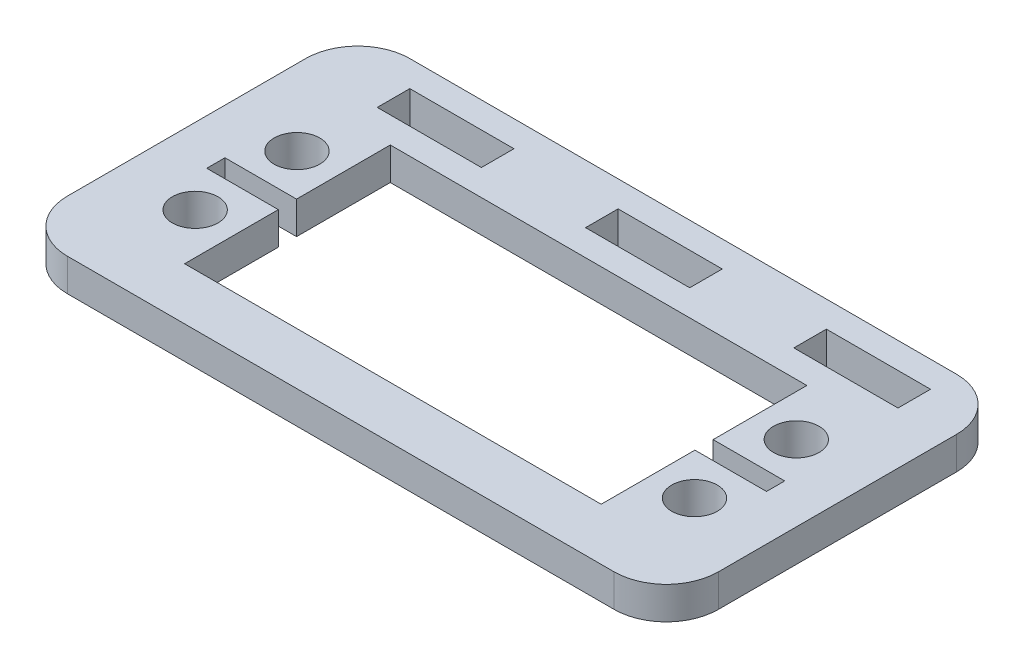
ISO-10303-21;
HEADER;
FILE_DESCRIPTION(('STEP AP214'),'2;1');
FILE_NAME('part.step','',(''),(''),'','','');
FILE_SCHEMA(('AUTOMOTIVE_DESIGN { 1 0 10303 214 1 1 1 1 }'));
ENDSEC;
DATA;
#1=APPLICATION_CONTEXT('core data for automotive mechanical design processes');
#2=APPLICATION_PROTOCOL_DEFINITION('international standard','automotive_design',2000,#1);
#3=PRODUCT_CONTEXT('',#1,'mechanical');
#4=PRODUCT('Part','Part','',(#3));
#5=PRODUCT_RELATED_PRODUCT_CATEGORY('part','',(#4));
#6=PRODUCT_DEFINITION_FORMATION('','',#4);
#7=PRODUCT_DEFINITION_CONTEXT('part definition',#1,'design');
#8=PRODUCT_DEFINITION('design','',#6,#7);
#9=PRODUCT_DEFINITION_SHAPE('','',#8);
#10=(LENGTH_UNIT() NAMED_UNIT(*) SI_UNIT(.MILLI.,.METRE.));
#11=(NAMED_UNIT(*) PLANE_ANGLE_UNIT() SI_UNIT($,.RADIAN.));
#12=(NAMED_UNIT(*) SI_UNIT($,.STERADIAN.) SOLID_ANGLE_UNIT());
#13=UNCERTAINTY_MEASURE_WITH_UNIT(LENGTH_MEASURE(1.E-05),#10,'distance_accuracy_value','');
#14=(GEOMETRIC_REPRESENTATION_CONTEXT(3) GLOBAL_UNCERTAINTY_ASSIGNED_CONTEXT((#13)) GLOBAL_UNIT_ASSIGNED_CONTEXT((#10,
#11,#12)) REPRESENTATION_CONTEXT('',''));
#15=CARTESIAN_POINT('',(0.,0.,0.));
#16=DIRECTION('',(0.,0.,1.));
#17=DIRECTION('',(1.,0.,0.));
#18=AXIS2_PLACEMENT_3D('',#15,#16,#17);
#19=CARTESIAN_POINT('',(20.32,3.175,10.033));
#20=DIRECTION('',(-1.,0.,0.));
#21=DIRECTION('',(0.,0.,1.));
#22=AXIS2_PLACEMENT_3D('',#19,#20,#21);
#23=PLANE('',#22);
#24=DIRECTION('',(0.,1.,0.));
#25=VECTOR('',#24,1.);
#26=CARTESIAN_POINT('',(20.32,0.,0.888999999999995));
#27=LINE('',#26,#25);
#28=CARTESIAN_POINT('',(20.32,0.,0.888999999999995));
#29=VERTEX_POINT('',#28);
#30=CARTESIAN_POINT('',(20.32,3.175,0.888999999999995));
#31=VERTEX_POINT('',#30);
#32=EDGE_CURVE('E310',#29,#31,#27,.T.);
#33=ORIENTED_EDGE('',*,*,#32,.F.);
#34=DIRECTION('',(0.,0.,-1.));
#35=VECTOR('',#34,1.);
#36=CARTESIAN_POINT('',(20.32,0.,10.033));
#37=LINE('',#36,#35);
#38=CARTESIAN_POINT('',(20.32,0.,10.033));
#39=VERTEX_POINT('',#38);
#40=EDGE_CURVE('E353',#39,#29,#37,.T.);
#41=ORIENTED_EDGE('',*,*,#40,.F.);
#42=DIRECTION('',(0.,-1.,0.));
#43=VECTOR('',#42,1.);
#44=CARTESIAN_POINT('',(20.32,3.175,10.033));
#45=LINE('',#44,#43);
#46=CARTESIAN_POINT('',(20.32,3.175,10.033));
#47=VERTEX_POINT('',#46);
#48=EDGE_CURVE('E352',#47,#39,#45,.T.);
#49=ORIENTED_EDGE('',*,*,#48,.F.);
#50=DIRECTION('',(0.,0.,-1.));
#51=VECTOR('',#50,1.);
#52=CARTESIAN_POINT('',(20.32,3.175,10.033));
#53=LINE('',#52,#51);
#54=EDGE_CURVE('E340',#47,#31,#53,.T.);
#55=ORIENTED_EDGE('',*,*,#54,.T.);
#56=EDGE_LOOP('',(#33,#41,#49,#55));
#57=FACE_BOUND('',#56,.T.);
#58=ADVANCED_FACE('F39',(#57),#23,.T.);
#59=CARTESIAN_POINT('',(-20.32,3.175,10.033));
#60=DIRECTION('',(1.,0.,0.));
#61=DIRECTION('',(0.,0.,-1.));
#62=AXIS2_PLACEMENT_3D('',#59,#60,#61);
#63=PLANE('',#62);
#64=DIRECTION('',(0.,1.,0.));
#65=VECTOR('',#64,1.);
#66=CARTESIAN_POINT('',(-20.32,0.,0.889));
#67=LINE('',#66,#65);
#68=CARTESIAN_POINT('',(-20.32,0.,0.889));
#69=VERTEX_POINT('',#68);
#70=CARTESIAN_POINT('',(-20.32,3.175,0.889));
#71=VERTEX_POINT('',#70);
#72=EDGE_CURVE('E285',#69,#71,#67,.T.);
#73=ORIENTED_EDGE('',*,*,#72,.T.);
#74=DIRECTION('',(0.,0.,1.));
#75=VECTOR('',#74,1.);
#76=CARTESIAN_POINT('',(-20.32,3.175,10.033));
#77=LINE('',#76,#75);
#78=CARTESIAN_POINT('',(-20.32,3.175,10.033));
#79=VERTEX_POINT('',#78);
#80=EDGE_CURVE('E346',#71,#79,#77,.T.);
#81=ORIENTED_EDGE('',*,*,#80,.T.);
#82=DIRECTION('',(0.,-1.,0.));
#83=VECTOR('',#82,1.);
#84=CARTESIAN_POINT('',(-20.32,3.175,10.033));
#85=LINE('',#84,#83);
#86=CARTESIAN_POINT('',(-20.32,0.,10.033));
#87=VERTEX_POINT('',#86);
#88=EDGE_CURVE('E365',#79,#87,#85,.T.);
#89=ORIENTED_EDGE('',*,*,#88,.T.);
#90=DIRECTION('',(0.,0.,1.));
#91=VECTOR('',#90,1.);
#92=CARTESIAN_POINT('',(-20.32,0.,10.033));
#93=LINE('',#92,#91);
#94=EDGE_CURVE('E358',#69,#87,#93,.T.);
#95=ORIENTED_EDGE('',*,*,#94,.F.);
#96=EDGE_LOOP('',(#73,#81,#89,#95));
#97=FACE_BOUND('',#96,.T.);
#98=ADVANCED_FACE('F556',(#97),#63,.T.);
#99=CARTESIAN_POINT('',(31.75,3.175,15.113));
#100=DIRECTION('',(0.,-1.,0.));
#101=DIRECTION('',(0.,0.,-1.));
#102=AXIS2_PLACEMENT_3D('',#99,#100,#101);
#103=PLANE('',#102);
#104=CARTESIAN_POINT('',(24.3572464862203,3.175,-4.96569999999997));
#105=DIRECTION('',(0.,1.,0.));
#106=DIRECTION('',(0.,0.,-1.));
#107=AXIS2_PLACEMENT_3D('',#104,#105,#106);
#108=CIRCLE('',#107,2.2225);
#109=CARTESIAN_POINT('',(24.3572464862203,3.175,-7.18819999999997));
#110=VERTEX_POINT('',#109);
#111=EDGE_CURVE('E288',#110,#110,#108,.T.);
#112=ORIENTED_EDGE('',*,*,#111,.F.);
#113=EDGE_LOOP('',(#112));
#114=FACE_BOUND('',#113,.T.);
#115=CARTESIAN_POINT('',(24.3572464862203,3.175,4.96570000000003));
#116=DIRECTION('',(0.,1.,0.));
#117=DIRECTION('',(0.,0.,-1.));
#118=AXIS2_PLACEMENT_3D('',#115,#116,#117);
#119=CIRCLE('',#118,2.2225);
#120=CARTESIAN_POINT('',(24.3572464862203,3.175,2.74320000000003));
#121=VERTEX_POINT('',#120);
#122=EDGE_CURVE('E326',#121,#121,#119,.T.);
#123=ORIENTED_EDGE('',*,*,#122,.F.);
#124=EDGE_LOOP('',(#123));
#125=FACE_BOUND('',#124,.T.);
#126=CARTESIAN_POINT('',(-24.3572464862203,3.175,4.96570000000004));
#127=DIRECTION('',(0.,1.,0.));
#128=DIRECTION('',(0.,0.,1.));
#129=AXIS2_PLACEMENT_3D('',#126,#127,#128);
#130=CIRCLE('',#129,2.2225);
#131=CARTESIAN_POINT('',(-24.3572464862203,3.175,7.18820000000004));
#132=VERTEX_POINT('',#131);
#133=EDGE_CURVE('E320',#132,#132,#130,.T.);
#134=ORIENTED_EDGE('',*,*,#133,.F.);
#135=EDGE_LOOP('',(#134));
#136=FACE_BOUND('',#135,.T.);
#137=CARTESIAN_POINT('',(-24.3572464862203,3.175,-4.96569999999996));
#138=DIRECTION('',(0.,1.,0.));
#139=DIRECTION('',(0.,0.,1.));
#140=AXIS2_PLACEMENT_3D('',#137,#138,#139);
#141=CIRCLE('',#140,2.2225);
#142=CARTESIAN_POINT('',(-24.3572464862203,3.175,-2.74319999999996));
#143=VERTEX_POINT('',#142);
#144=EDGE_CURVE('E319',#143,#143,#141,.T.);
#145=ORIENTED_EDGE('',*,*,#144,.F.);
#146=EDGE_LOOP('',(#145));
#147=FACE_BOUND('',#146,.T.);
#148=DIRECTION('',(0.,0.,1.));
#149=VECTOR('',#148,1.);
#150=CARTESIAN_POINT('',(-24.13,3.175,-15.7479999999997));
#151=LINE('',#150,#149);
#152=CARTESIAN_POINT('',(-24.13,3.175,-15.7479999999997));
#153=VERTEX_POINT('',#152);
#154=CARTESIAN_POINT('',(-24.13,3.175,-12.5729999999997));
#155=VERTEX_POINT('',#154);
#156=EDGE_CURVE('E374',#153,#155,#151,.T.);
#157=ORIENTED_EDGE('',*,*,#156,.F.);
#158=DIRECTION('',(-1.,0.,0.));
#159=VECTOR('',#158,1.);
#160=CARTESIAN_POINT('',(-13.97,3.175,-15.7479999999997));
#161=LINE('',#160,#159);
#162=CARTESIAN_POINT('',(-13.97,3.175,-15.7479999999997));
#163=VERTEX_POINT('',#162);
#164=EDGE_CURVE('E382',#163,#153,#161,.T.);
#165=ORIENTED_EDGE('',*,*,#164,.F.);
#166=DIRECTION('',(0.,0.,-1.));
#167=VECTOR('',#166,1.);
#168=CARTESIAN_POINT('',(-13.97,3.175,-15.7479999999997));
#169=LINE('',#168,#167);
#170=CARTESIAN_POINT('',(-13.97,3.175,-12.5729999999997));
#171=VERTEX_POINT('',#170);
#172=EDGE_CURVE('E379',#171,#163,#169,.T.);
#173=ORIENTED_EDGE('',*,*,#172,.F.);
#174=DIRECTION('',(1.,0.,0.));
#175=VECTOR('',#174,1.);
#176=CARTESIAN_POINT('',(-13.97,3.175,-12.5729999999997));
#177=LINE('',#176,#175);
#178=EDGE_CURVE('E376',#155,#171,#177,.T.);
#179=ORIENTED_EDGE('',*,*,#178,.F.);
#180=EDGE_LOOP('',(#157,#165,#173,#179));
#181=FACE_BOUND('',#180,.T.);
#182=DIRECTION('',(0.,0.,1.));
#183=VECTOR('',#182,1.);
#184=CARTESIAN_POINT('',(16.51,3.175,-15.748));
#185=LINE('',#184,#183);
#186=CARTESIAN_POINT('',(16.51,3.175,-15.748));
#187=VERTEX_POINT('',#186);
#188=CARTESIAN_POINT('',(16.51,3.175,-12.573));
#189=VERTEX_POINT('',#188);
#190=EDGE_CURVE('E436',#187,#189,#185,.T.);
#191=ORIENTED_EDGE('',*,*,#190,.F.);
#192=DIRECTION('',(-1.,0.,0.));
#193=VECTOR('',#192,1.);
#194=CARTESIAN_POINT('',(26.67,3.175,-15.748));
#195=LINE('',#194,#193);
#196=CARTESIAN_POINT('',(26.67,3.175,-15.748));
#197=VERTEX_POINT('',#196);
#198=EDGE_CURVE('E444',#197,#187,#195,.T.);
#199=ORIENTED_EDGE('',*,*,#198,.F.);
#200=DIRECTION('',(0.,0.,-1.));
#201=VECTOR('',#200,1.);
#202=CARTESIAN_POINT('',(26.67,3.175,-15.748));
#203=LINE('',#202,#201);
#204=CARTESIAN_POINT('',(26.67,3.175,-12.573));
#205=VERTEX_POINT('',#204);
#206=EDGE_CURVE('E441',#205,#197,#203,.T.);
#207=ORIENTED_EDGE('',*,*,#206,.F.);
#208=DIRECTION('',(1.,0.,0.));
#209=VECTOR('',#208,1.);
#210=CARTESIAN_POINT('',(26.67,3.175,-12.573));
#211=LINE('',#210,#209);
#212=EDGE_CURVE('E438',#189,#205,#211,.T.);
#213=ORIENTED_EDGE('',*,*,#212,.F.);
#214=EDGE_LOOP('',(#191,#199,#207,#213));
#215=FACE_BOUND('',#214,.T.);
#216=DIRECTION('',(0.,0.,-1.));
#217=VECTOR('',#216,1.);
#218=CARTESIAN_POINT('',(31.75,3.175,-18.288));
#219=LINE('',#218,#217);
#220=CARTESIAN_POINT('',(31.75,3.175,10.033));
#221=VERTEX_POINT('',#220);
#222=CARTESIAN_POINT('',(31.75,3.175,-13.208));
#223=VERTEX_POINT('',#222);
#224=EDGE_CURVE('E467',#221,#223,#219,.T.);
#225=ORIENTED_EDGE('',*,*,#224,.T.);
#226=CARTESIAN_POINT('',(26.67,3.175,-13.208));
#227=DIRECTION('',(0.,-1.,0.));
#228=DIRECTION('',(0.,0.,-1.));
#229=AXIS2_PLACEMENT_3D('',#226,#227,#228);
#230=CIRCLE('',#229,5.08);
#231=CARTESIAN_POINT('',(26.67,3.175,-18.288));
#232=VERTEX_POINT('',#231);
#233=EDGE_CURVE('E510',#223,#232,#230,.F.);
#234=ORIENTED_EDGE('',*,*,#233,.T.);
#235=DIRECTION('',(-1.,0.,0.));
#236=VECTOR('',#235,1.);
#237=CARTESIAN_POINT('',(31.75,3.175,-18.288));
#238=LINE('',#237,#236);
#239=CARTESIAN_POINT('',(-26.67,3.175,-18.288));
#240=VERTEX_POINT('',#239);
#241=EDGE_CURVE('E470',#232,#240,#238,.T.);
#242=ORIENTED_EDGE('',*,*,#241,.T.);
#243=CARTESIAN_POINT('',(-26.67,3.175,-13.208));
#244=DIRECTION('',(0.,-1.,0.));
#245=DIRECTION('',(0.,0.,-1.));
#246=AXIS2_PLACEMENT_3D('',#243,#244,#245);
#247=CIRCLE('',#246,5.08);
#248=CARTESIAN_POINT('',(-31.75,3.175,-13.208));
#249=VERTEX_POINT('',#248);
#250=EDGE_CURVE('E505',#240,#249,#247,.F.);
#251=ORIENTED_EDGE('',*,*,#250,.T.);
#252=DIRECTION('',(0.,0.,1.));
#253=VECTOR('',#252,1.);
#254=CARTESIAN_POINT('',(-31.75,3.175,-18.288));
#255=LINE('',#254,#253);
#256=CARTESIAN_POINT('',(-31.75,3.175,10.033));
#257=VERTEX_POINT('',#256);
#258=EDGE_CURVE('E474',#249,#257,#255,.T.);
#259=ORIENTED_EDGE('',*,*,#258,.T.);
#260=CARTESIAN_POINT('',(-26.67,3.175,10.033));
#261=DIRECTION('',(0.,-1.,0.));
#262=DIRECTION('',(0.,0.,-1.));
#263=AXIS2_PLACEMENT_3D('',#260,#261,#262);
#264=CIRCLE('',#263,5.08);
#265=CARTESIAN_POINT('',(-26.67,3.175,15.113));
#266=VERTEX_POINT('',#265);
#267=EDGE_CURVE('E61',#257,#266,#264,.F.);
#268=ORIENTED_EDGE('',*,*,#267,.T.);
#269=DIRECTION('',(1.,0.,0.));
#270=VECTOR('',#269,1.);
#271=CARTESIAN_POINT('',(31.75,3.175,15.113));
#272=LINE('',#271,#270);
#273=CARTESIAN_POINT('',(26.67,3.175,15.113));
#274=VERTEX_POINT('',#273);
#275=EDGE_CURVE('E476',#266,#274,#272,.T.);
#276=ORIENTED_EDGE('',*,*,#275,.T.);
#277=CARTESIAN_POINT('',(26.67,3.175,10.033));
#278=DIRECTION('',(0.,-1.,0.));
#279=DIRECTION('',(0.,0.,-1.));
#280=AXIS2_PLACEMENT_3D('',#277,#278,#279);
#281=CIRCLE('',#280,5.08);
#282=EDGE_CURVE('E508',#274,#221,#281,.F.);
#283=ORIENTED_EDGE('',*,*,#282,.T.);
#284=EDGE_LOOP('',(#225,#234,#242,#251,#259,#268,#276,#283));
#285=FACE_BOUND('',#284,.T.);
#286=DIRECTION('',(0.,0.,1.));
#287=VECTOR('',#286,1.);
#288=CARTESIAN_POINT('',(-3.81,3.175,-15.7479999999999));
#289=LINE('',#288,#287);
#290=CARTESIAN_POINT('',(-3.81,3.175,-15.7479999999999));
#291=VERTEX_POINT('',#290);
#292=CARTESIAN_POINT('',(-3.81,3.175,-12.5729999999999));
#293=VERTEX_POINT('',#292);
#294=EDGE_CURVE('E405',#291,#293,#289,.T.);
#295=ORIENTED_EDGE('',*,*,#294,.F.);
#296=DIRECTION('',(-1.,0.,0.));
#297=VECTOR('',#296,1.);
#298=CARTESIAN_POINT('',(6.35,3.175,-15.7479999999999));
#299=LINE('',#298,#297);
#300=CARTESIAN_POINT('',(6.34999999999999,3.175,-15.7479999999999));
#301=VERTEX_POINT('',#300);
#302=EDGE_CURVE('E413',#301,#291,#299,.T.);
#303=ORIENTED_EDGE('',*,*,#302,.F.);
#304=DIRECTION('',(0.,0.,-1.));
#305=VECTOR('',#304,1.);
#306=CARTESIAN_POINT('',(6.35,3.175,-15.7479999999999));
#307=LINE('',#306,#305);
#308=CARTESIAN_POINT('',(6.35,3.175,-12.5729999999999));
#309=VERTEX_POINT('',#308);
#310=EDGE_CURVE('E410',#309,#301,#307,.T.);
#311=ORIENTED_EDGE('',*,*,#310,.F.);
#312=DIRECTION('',(1.,0.,0.));
#313=VECTOR('',#312,1.);
#314=CARTESIAN_POINT('',(6.35,3.175,-12.5729999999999));
#315=LINE('',#314,#313);
#316=EDGE_CURVE('E407',#293,#309,#315,.T.);
#317=ORIENTED_EDGE('',*,*,#316,.F.);
#318=EDGE_LOOP('',(#295,#303,#311,#317));
#319=FACE_BOUND('',#318,.T.);
#320=ORIENTED_EDGE('',*,*,#80,.F.);
#321=DIRECTION('',(1.,0.,0.));
#322=VECTOR('',#321,1.);
#323=CARTESIAN_POINT('',(-27.305,3.175,0.889000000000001));
#324=LINE('',#323,#322);
#325=CARTESIAN_POINT('',(-27.305,3.175,0.889000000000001));
#326=VERTEX_POINT('',#325);
#327=EDGE_CURVE('E276',#326,#71,#324,.T.);
#328=ORIENTED_EDGE('',*,*,#327,.F.);
#329=DIRECTION('',(0.,0.,1.));
#330=VECTOR('',#329,1.);
#331=CARTESIAN_POINT('',(-27.305,3.175,-0.888999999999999));
#332=LINE('',#331,#330);
#333=CARTESIAN_POINT('',(-27.305,3.175,-0.888999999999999));
#334=VERTEX_POINT('',#333);
#335=EDGE_CURVE('E278',#334,#326,#332,.T.);
#336=ORIENTED_EDGE('',*,*,#335,.F.);
#337=DIRECTION('',(-1.,0.,0.));
#338=VECTOR('',#337,1.);
#339=CARTESIAN_POINT('',(-20.32,3.175,-0.889));
#340=LINE('',#339,#338);
#341=CARTESIAN_POINT('',(-20.32,3.175,-0.889));
#342=VERTEX_POINT('',#341);
#343=EDGE_CURVE('E255',#342,#334,#340,.T.);
#344=ORIENTED_EDGE('',*,*,#343,.F.);
#345=CARTESIAN_POINT('',(-20.32,3.175,-10.033));
#346=VERTEX_POINT('',#345);
#347=EDGE_CURVE('E347',#346,#342,#77,.T.);
#348=ORIENTED_EDGE('',*,*,#347,.F.);
#349=DIRECTION('',(-1.,0.,0.));
#350=VECTOR('',#349,1.);
#351=CARTESIAN_POINT('',(-20.32,3.175,-10.033));
#352=LINE('',#351,#350);
#353=CARTESIAN_POINT('',(20.32,3.175,-10.033));
#354=VERTEX_POINT('',#353);
#355=EDGE_CURVE('E343',#354,#346,#352,.T.);
#356=ORIENTED_EDGE('',*,*,#355,.F.);
#357=CARTESIAN_POINT('',(20.32,3.175,-0.889000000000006));
#358=VERTEX_POINT('',#357);
#359=EDGE_CURVE('E344',#358,#354,#53,.T.);
#360=ORIENTED_EDGE('',*,*,#359,.F.);
#361=DIRECTION('',(-1.,0.,0.));
#362=VECTOR('',#361,1.);
#363=CARTESIAN_POINT('',(20.32,3.175,-0.889000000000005));
#364=LINE('',#363,#362);
#365=CARTESIAN_POINT('',(27.305,3.175,-0.889000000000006));
#366=VERTEX_POINT('',#365);
#367=EDGE_CURVE('E305',#366,#358,#364,.T.);
#368=ORIENTED_EDGE('',*,*,#367,.F.);
#369=DIRECTION('',(0.,0.,-1.));
#370=VECTOR('',#369,1.);
#371=CARTESIAN_POINT('',(27.305,3.175,-0.889000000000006));
#372=LINE('',#371,#370);
#373=CARTESIAN_POINT('',(27.305,3.175,0.888999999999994));
#374=VERTEX_POINT('',#373);
#375=EDGE_CURVE('E302',#374,#366,#372,.T.);
#376=ORIENTED_EDGE('',*,*,#375,.F.);
#377=DIRECTION('',(1.,0.,0.));
#378=VECTOR('',#377,1.);
#379=CARTESIAN_POINT('',(27.305,3.175,0.888999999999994));
#380=LINE('',#379,#378);
#381=EDGE_CURVE('E295',#31,#374,#380,.T.);
#382=ORIENTED_EDGE('',*,*,#381,.F.);
#383=ORIENTED_EDGE('',*,*,#54,.F.);
#384=DIRECTION('',(1.,0.,0.));
#385=VECTOR('',#384,1.);
#386=CARTESIAN_POINT('',(-20.32,3.175,10.033));
#387=LINE('',#386,#385);
#388=EDGE_CURVE('E350',#79,#47,#387,.T.);
#389=ORIENTED_EDGE('',*,*,#388,.F.);
#390=EDGE_LOOP('',(#320,#328,#336,#344,#348,#356,#360,#368,#376,#382,#383,#389));
#391=FACE_BOUND('',#390,.T.);
#392=ADVANCED_FACE('F533',(#114,#125,#136,#147,#181,#215,#285,#319,#391),#103,.F.);
#393=CARTESIAN_POINT('',(31.75,0.,15.113));
#394=DIRECTION('',(0.,-1.,0.));
#395=DIRECTION('',(0.,0.,-1.));
#396=AXIS2_PLACEMENT_3D('',#393,#394,#395);
#397=PLANE('',#396);
#398=DIRECTION('',(1.,0.,0.));
#399=VECTOR('',#398,1.);
#400=CARTESIAN_POINT('',(-27.305,0.,0.889000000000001));
#401=LINE('',#400,#399);
#402=CARTESIAN_POINT('',(-27.305,0.,0.889000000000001));
#403=VERTEX_POINT('',#402);
#404=EDGE_CURVE('E268',#403,#69,#401,.T.);
#405=ORIENTED_EDGE('',*,*,#404,.T.);
#406=ORIENTED_EDGE('',*,*,#94,.T.);
#407=DIRECTION('',(1.,0.,0.));
#408=VECTOR('',#407,1.);
#409=CARTESIAN_POINT('',(-20.32,0.,10.033));
#410=LINE('',#409,#408);
#411=EDGE_CURVE('E360',#87,#39,#410,.T.);
#412=ORIENTED_EDGE('',*,*,#411,.T.);
#413=ORIENTED_EDGE('',*,*,#40,.T.);
#414=DIRECTION('',(1.,0.,0.));
#415=VECTOR('',#414,1.);
#416=CARTESIAN_POINT('',(27.305,0.,0.888999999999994));
#417=LINE('',#416,#415);
#418=CARTESIAN_POINT('',(27.305,0.,0.888999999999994));
#419=VERTEX_POINT('',#418);
#420=EDGE_CURVE('E298',#29,#419,#417,.T.);
#421=ORIENTED_EDGE('',*,*,#420,.T.);
#422=DIRECTION('',(0.,0.,-1.));
#423=VECTOR('',#422,1.);
#424=CARTESIAN_POINT('',(27.305,0.,-0.889000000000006));
#425=LINE('',#424,#423);
#426=CARTESIAN_POINT('',(27.305,0.,-0.889000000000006));
#427=VERTEX_POINT('',#426);
#428=EDGE_CURVE('E291',#419,#427,#425,.T.);
#429=ORIENTED_EDGE('',*,*,#428,.T.);
#430=DIRECTION('',(-1.,0.,0.));
#431=VECTOR('',#430,1.);
#432=CARTESIAN_POINT('',(20.32,0.,-0.889000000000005));
#433=LINE('',#432,#431);
#434=CARTESIAN_POINT('',(20.32,0.,-0.889000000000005));
#435=VERTEX_POINT('',#434);
#436=EDGE_CURVE('E294',#427,#435,#433,.T.);
#437=ORIENTED_EDGE('',*,*,#436,.T.);
#438=CARTESIAN_POINT('',(20.32,0.,-10.033));
#439=VERTEX_POINT('',#438);
#440=EDGE_CURVE('E337',#435,#439,#37,.T.);
#441=ORIENTED_EDGE('',*,*,#440,.T.);
#442=DIRECTION('',(-1.,0.,0.));
#443=VECTOR('',#442,1.);
#444=CARTESIAN_POINT('',(-20.32,0.,-10.033));
#445=LINE('',#444,#443);
#446=CARTESIAN_POINT('',(-20.32,0.,-10.033));
#447=VERTEX_POINT('',#446);
#448=EDGE_CURVE('E356',#439,#447,#445,.T.);
#449=ORIENTED_EDGE('',*,*,#448,.T.);
#450=CARTESIAN_POINT('',(-20.32,0.,-0.889000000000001));
#451=VERTEX_POINT('',#450);
#452=EDGE_CURVE('E275',#447,#451,#93,.T.);
#453=ORIENTED_EDGE('',*,*,#452,.T.);
#454=DIRECTION('',(-1.,0.,0.));
#455=VECTOR('',#454,1.);
#456=CARTESIAN_POINT('',(-20.32,0.,-0.889));
#457=LINE('',#456,#455);
#458=CARTESIAN_POINT('',(-27.305,0.,-0.888999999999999));
#459=VERTEX_POINT('',#458);
#460=EDGE_CURVE('E252',#451,#459,#457,.T.);
#461=ORIENTED_EDGE('',*,*,#460,.T.);
#462=DIRECTION('',(0.,0.,1.));
#463=VECTOR('',#462,1.);
#464=CARTESIAN_POINT('',(-27.305,0.,-0.888999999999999));
#465=LINE('',#464,#463);
#466=EDGE_CURVE('E263',#459,#403,#465,.T.);
#467=ORIENTED_EDGE('',*,*,#466,.T.);
#468=EDGE_LOOP('',(#405,#406,#412,#413,#421,#429,#437,#441,#449,#453,#461,#467));
#469=FACE_BOUND('',#468,.T.);
#470=CARTESIAN_POINT('',(24.3572464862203,0.,-4.96569999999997));
#471=DIRECTION('',(0.,1.,0.));
#472=DIRECTION('',(0.,0.,-1.));
#473=AXIS2_PLACEMENT_3D('',#470,#471,#472);
#474=CIRCLE('',#473,2.2225);
#475=CARTESIAN_POINT('',(24.3572464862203,0.,-7.18819999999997));
#476=VERTEX_POINT('',#475);
#477=EDGE_CURVE('E329',#476,#476,#474,.T.);
#478=ORIENTED_EDGE('',*,*,#477,.T.);
#479=EDGE_LOOP('',(#478));
#480=FACE_BOUND('',#479,.T.);
#481=CARTESIAN_POINT('',(24.3572464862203,0.,4.96570000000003));
#482=DIRECTION('',(0.,1.,0.));
#483=DIRECTION('',(0.,0.,-1.));
#484=AXIS2_PLACEMENT_3D('',#481,#482,#483);
#485=CIRCLE('',#484,2.2225);
#486=CARTESIAN_POINT('',(24.3572464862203,0.,2.74320000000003));
#487=VERTEX_POINT('',#486);
#488=EDGE_CURVE('E323',#487,#487,#485,.T.);
#489=ORIENTED_EDGE('',*,*,#488,.T.);
#490=EDGE_LOOP('',(#489));
#491=FACE_BOUND('',#490,.T.);
#492=CARTESIAN_POINT('',(-24.3572464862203,0.,4.96570000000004));
#493=DIRECTION('',(0.,1.,0.));
#494=DIRECTION('',(0.,0.,1.));
#495=AXIS2_PLACEMENT_3D('',#492,#493,#494);
#496=CIRCLE('',#495,2.2225);
#497=CARTESIAN_POINT('',(-24.3572464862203,0.,7.18820000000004));
#498=VERTEX_POINT('',#497);
#499=EDGE_CURVE('E316',#498,#498,#496,.T.);
#500=ORIENTED_EDGE('',*,*,#499,.T.);
#501=EDGE_LOOP('',(#500));
#502=FACE_BOUND('',#501,.T.);
#503=CARTESIAN_POINT('',(-24.3572464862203,0.,-4.96569999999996));
#504=DIRECTION('',(0.,1.,0.));
#505=DIRECTION('',(0.,0.,1.));
#506=AXIS2_PLACEMENT_3D('',#503,#504,#505);
#507=CIRCLE('',#506,2.2225);
#508=CARTESIAN_POINT('',(-24.3572464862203,0.,-2.74319999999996));
#509=VERTEX_POINT('',#508);
#510=EDGE_CURVE('E334',#509,#509,#507,.T.);
#511=ORIENTED_EDGE('',*,*,#510,.T.);
#512=EDGE_LOOP('',(#511));
#513=FACE_BOUND('',#512,.T.);
#514=DIRECTION('',(-1.,0.,0.));
#515=VECTOR('',#514,1.);
#516=CARTESIAN_POINT('',(31.75,0.,-18.288));
#517=LINE('',#516,#515);
#518=CARTESIAN_POINT('',(26.67,0.,-18.288));
#519=VERTEX_POINT('',#518);
#520=CARTESIAN_POINT('',(-26.67,0.,-18.288));
#521=VERTEX_POINT('',#520);
#522=EDGE_CURVE('E481',#519,#521,#517,.T.);
#523=ORIENTED_EDGE('',*,*,#522,.F.);
#524=CARTESIAN_POINT('',(26.67,0.,-13.208));
#525=DIRECTION('',(0.,-1.,0.));
#526=DIRECTION('',(0.,0.,-1.));
#527=AXIS2_PLACEMENT_3D('',#524,#525,#526);
#528=CIRCLE('',#527,5.08);
#529=CARTESIAN_POINT('',(31.75,0.,-13.208));
#530=VERTEX_POINT('',#529);
#531=EDGE_CURVE('E498',#519,#530,#528,.T.);
#532=ORIENTED_EDGE('',*,*,#531,.T.);
#533=DIRECTION('',(0.,0.,-1.));
#534=VECTOR('',#533,1.);
#535=CARTESIAN_POINT('',(31.75,0.,-18.288));
#536=LINE('',#535,#534);
#537=CARTESIAN_POINT('',(31.75,0.,10.033));
#538=VERTEX_POINT('',#537);
#539=EDGE_CURVE('E466',#538,#530,#536,.T.);
#540=ORIENTED_EDGE('',*,*,#539,.F.);
#541=CARTESIAN_POINT('',(26.67,0.,10.033));
#542=DIRECTION('',(0.,-1.,0.));
#543=DIRECTION('',(0.,0.,-1.));
#544=AXIS2_PLACEMENT_3D('',#541,#542,#543);
#545=CIRCLE('',#544,5.08);
#546=CARTESIAN_POINT('',(26.67,0.,15.113));
#547=VERTEX_POINT('',#546);
#548=EDGE_CURVE('E496',#538,#547,#545,.T.);
#549=ORIENTED_EDGE('',*,*,#548,.T.);
#550=DIRECTION('',(1.,0.,0.));
#551=VECTOR('',#550,1.);
#552=CARTESIAN_POINT('',(31.75,0.,15.113));
#553=LINE('',#552,#551);
#554=CARTESIAN_POINT('',(-26.67,0.,15.113));
#555=VERTEX_POINT('',#554);
#556=EDGE_CURVE('E471',#555,#547,#553,.T.);
#557=ORIENTED_EDGE('',*,*,#556,.F.);
#558=CARTESIAN_POINT('',(-26.67,0.,10.033));
#559=DIRECTION('',(0.,-1.,0.));
#560=DIRECTION('',(0.,0.,-1.));
#561=AXIS2_PLACEMENT_3D('',#558,#559,#560);
#562=CIRCLE('',#561,5.08);
#563=CARTESIAN_POINT('',(-31.75,0.,10.033));
#564=VERTEX_POINT('',#563);
#565=EDGE_CURVE('E494',#555,#564,#562,.T.);
#566=ORIENTED_EDGE('',*,*,#565,.T.);
#567=DIRECTION('',(0.,0.,1.));
#568=VECTOR('',#567,1.);
#569=CARTESIAN_POINT('',(-31.75,0.,-18.288));
#570=LINE('',#569,#568);
#571=CARTESIAN_POINT('',(-31.75,0.,-13.208));
#572=VERTEX_POINT('',#571);
#573=EDGE_CURVE('E484',#572,#564,#570,.T.);
#574=ORIENTED_EDGE('',*,*,#573,.F.);
#575=CARTESIAN_POINT('',(-26.67,0.,-13.208));
#576=DIRECTION('',(0.,-1.,0.));
#577=DIRECTION('',(0.,0.,-1.));
#578=AXIS2_PLACEMENT_3D('',#575,#576,#577);
#579=CIRCLE('',#578,5.08);
#580=EDGE_CURVE('E492',#572,#521,#579,.T.);
#581=ORIENTED_EDGE('',*,*,#580,.T.);
#582=EDGE_LOOP('',(#523,#532,#540,#549,#557,#566,#574,#581));
#583=FACE_BOUND('',#582,.T.);
#584=DIRECTION('',(-1.,0.,0.));
#585=VECTOR('',#584,1.);
#586=CARTESIAN_POINT('',(26.67,0.,-15.748));
#587=LINE('',#586,#585);
#588=CARTESIAN_POINT('',(26.67,0.,-15.748));
#589=VERTEX_POINT('',#588);
#590=CARTESIAN_POINT('',(16.51,0.,-15.748));
#591=VERTEX_POINT('',#590);
#592=EDGE_CURVE('E439',#589,#591,#587,.T.);
#593=ORIENTED_EDGE('',*,*,#592,.T.);
#594=DIRECTION('',(0.,0.,1.));
#595=VECTOR('',#594,1.);
#596=CARTESIAN_POINT('',(16.51,0.,-15.748));
#597=LINE('',#596,#595);
#598=CARTESIAN_POINT('',(16.51,0.,-12.573));
#599=VERTEX_POINT('',#598);
#600=EDGE_CURVE('E435',#591,#599,#597,.T.);
#601=ORIENTED_EDGE('',*,*,#600,.T.);
#602=DIRECTION('',(1.,0.,0.));
#603=VECTOR('',#602,1.);
#604=CARTESIAN_POINT('',(26.67,0.,-12.573));
#605=LINE('',#604,#603);
#606=CARTESIAN_POINT('',(26.67,0.,-12.573));
#607=VERTEX_POINT('',#606);
#608=EDGE_CURVE('E449',#599,#607,#605,.T.);
#609=ORIENTED_EDGE('',*,*,#608,.T.);
#610=DIRECTION('',(0.,0.,-1.));
#611=VECTOR('',#610,1.);
#612=CARTESIAN_POINT('',(26.67,0.,-15.748));
#613=LINE('',#612,#611);
#614=EDGE_CURVE('E452',#607,#589,#613,.T.);
#615=ORIENTED_EDGE('',*,*,#614,.T.);
#616=EDGE_LOOP('',(#593,#601,#609,#615));
#617=FACE_BOUND('',#616,.T.);
#618=DIRECTION('',(-1.,0.,0.));
#619=VECTOR('',#618,1.);
#620=CARTESIAN_POINT('',(6.35,0.,-15.7479999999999));
#621=LINE('',#620,#619);
#622=CARTESIAN_POINT('',(6.35,0.,-15.7479999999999));
#623=VERTEX_POINT('',#622);
#624=CARTESIAN_POINT('',(-3.81,0.,-15.7479999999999));
#625=VERTEX_POINT('',#624);
#626=EDGE_CURVE('E408',#623,#625,#621,.T.);
#627=ORIENTED_EDGE('',*,*,#626,.T.);
#628=DIRECTION('',(0.,0.,1.));
#629=VECTOR('',#628,1.);
#630=CARTESIAN_POINT('',(-3.81,0.,-15.7479999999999));
#631=LINE('',#630,#629);
#632=CARTESIAN_POINT('',(-3.81,0.,-12.5729999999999));
#633=VERTEX_POINT('',#632);
#634=EDGE_CURVE('E404',#625,#633,#631,.T.);
#635=ORIENTED_EDGE('',*,*,#634,.T.);
#636=DIRECTION('',(1.,0.,0.));
#637=VECTOR('',#636,1.);
#638=CARTESIAN_POINT('',(6.35,0.,-12.5729999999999));
#639=LINE('',#638,#637);
#640=CARTESIAN_POINT('',(6.35,0.,-12.5729999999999));
#641=VERTEX_POINT('',#640);
#642=EDGE_CURVE('E418',#633,#641,#639,.T.);
#643=ORIENTED_EDGE('',*,*,#642,.T.);
#644=DIRECTION('',(0.,0.,-1.));
#645=VECTOR('',#644,1.);
#646=CARTESIAN_POINT('',(6.35,0.,-15.7479999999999));
#647=LINE('',#646,#645);
#648=EDGE_CURVE('E421',#641,#623,#647,.T.);
#649=ORIENTED_EDGE('',*,*,#648,.T.);
#650=EDGE_LOOP('',(#627,#635,#643,#649));
#651=FACE_BOUND('',#650,.T.);
#652=DIRECTION('',(-1.,0.,0.));
#653=VECTOR('',#652,1.);
#654=CARTESIAN_POINT('',(-13.97,0.,-15.7479999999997));
#655=LINE('',#654,#653);
#656=CARTESIAN_POINT('',(-13.97,0.,-15.7479999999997));
#657=VERTEX_POINT('',#656);
#658=CARTESIAN_POINT('',(-24.13,0.,-15.7479999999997));
#659=VERTEX_POINT('',#658);
#660=EDGE_CURVE('E377',#657,#659,#655,.T.);
#661=ORIENTED_EDGE('',*,*,#660,.T.);
#662=DIRECTION('',(0.,0.,1.));
#663=VECTOR('',#662,1.);
#664=CARTESIAN_POINT('',(-24.13,0.,-15.7479999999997));
#665=LINE('',#664,#663);
#666=CARTESIAN_POINT('',(-24.13,0.,-12.5729999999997));
#667=VERTEX_POINT('',#666);
#668=EDGE_CURVE('E373',#659,#667,#665,.T.);
#669=ORIENTED_EDGE('',*,*,#668,.T.);
#670=DIRECTION('',(1.,0.,0.));
#671=VECTOR('',#670,1.);
#672=CARTESIAN_POINT('',(-13.97,0.,-12.5729999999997));
#673=LINE('',#672,#671);
#674=CARTESIAN_POINT('',(-13.97,0.,-12.5729999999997));
#675=VERTEX_POINT('',#674);
#676=EDGE_CURVE('E387',#667,#675,#673,.T.);
#677=ORIENTED_EDGE('',*,*,#676,.T.);
#678=DIRECTION('',(0.,0.,-1.));
#679=VECTOR('',#678,1.);
#680=CARTESIAN_POINT('',(-13.97,0.,-15.7479999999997));
#681=LINE('',#680,#679);
#682=EDGE_CURVE('E390',#675,#657,#681,.T.);
#683=ORIENTED_EDGE('',*,*,#682,.T.);
#684=EDGE_LOOP('',(#661,#669,#677,#683));
#685=FACE_BOUND('',#684,.T.);
#686=ADVANCED_FACE('F271',(#469,#480,#491,#502,#513,#583,#617,#651,#685),#397,.T.);
#687=CARTESIAN_POINT('',(31.75,3.175,-18.288));
#688=DIRECTION('',(-1.,0.,0.));
#689=DIRECTION('',(0.,0.,1.));
#690=AXIS2_PLACEMENT_3D('',#687,#688,#689);
#691=PLANE('',#690);
#692=ORIENTED_EDGE('',*,*,#539,.T.);
#693=DIRECTION('',(0.,-1.,0.));
#694=VECTOR('',#693,1.);
#695=CARTESIAN_POINT('',(31.75,3.175,-13.208));
#696=LINE('',#695,#694);
#697=EDGE_CURVE('E503',#530,#223,#696,.F.);
#698=ORIENTED_EDGE('',*,*,#697,.T.);
#699=ORIENTED_EDGE('',*,*,#224,.F.);
#700=DIRECTION('',(0.,-1.,0.));
#701=VECTOR('',#700,1.);
#702=CARTESIAN_POINT('',(31.75,3.175,10.033));
#703=LINE('',#702,#701);
#704=EDGE_CURVE('E500',#221,#538,#703,.T.);
#705=ORIENTED_EDGE('',*,*,#704,.T.);
#706=EDGE_LOOP('',(#692,#698,#699,#705));
#707=FACE_BOUND('',#706,.T.);
#708=ADVANCED_FACE('F541',(#707),#691,.F.);
#709=CARTESIAN_POINT('',(31.75,3.175,-18.288));
#710=DIRECTION('',(0.,0.,1.));
#711=DIRECTION('',(1.,0.,0.));
#712=AXIS2_PLACEMENT_3D('',#709,#710,#711);
#713=PLANE('',#712);
#714=ORIENTED_EDGE('',*,*,#241,.F.);
#715=DIRECTION('',(0.,-1.,0.));
#716=VECTOR('',#715,1.);
#717=CARTESIAN_POINT('',(26.67,3.175,-18.288));
#718=LINE('',#717,#716);
#719=EDGE_CURVE('E489',#232,#519,#718,.T.);
#720=ORIENTED_EDGE('',*,*,#719,.T.);
#721=ORIENTED_EDGE('',*,*,#522,.T.);
#722=DIRECTION('',(0.,-1.,0.));
#723=VECTOR('',#722,1.);
#724=CARTESIAN_POINT('',(-26.67,3.175,-18.288));
#725=LINE('',#724,#723);
#726=EDGE_CURVE('E478',#521,#240,#725,.F.);
#727=ORIENTED_EDGE('',*,*,#726,.T.);
#728=EDGE_LOOP('',(#714,#720,#721,#727));
#729=FACE_BOUND('',#728,.T.);
#730=ADVANCED_FACE('F549',(#729),#713,.F.);
#731=CARTESIAN_POINT('',(-31.75,3.175,-18.288));
#732=DIRECTION('',(1.,0.,0.));
#733=DIRECTION('',(0.,0.,-1.));
#734=AXIS2_PLACEMENT_3D('',#731,#732,#733);
#735=PLANE('',#734);
#736=ORIENTED_EDGE('',*,*,#573,.T.);
#737=DIRECTION('',(0.,-1.,0.));
#738=VECTOR('',#737,1.);
#739=CARTESIAN_POINT('',(-31.75,3.175,10.033));
#740=LINE('',#739,#738);
#741=EDGE_CURVE('E11',#564,#257,#740,.F.);
#742=ORIENTED_EDGE('',*,*,#741,.T.);
#743=ORIENTED_EDGE('',*,*,#258,.F.);
#744=DIRECTION('',(0.,-1.,0.));
#745=VECTOR('',#744,1.);
#746=CARTESIAN_POINT('',(-31.75,3.175,-13.208));
#747=LINE('',#746,#745);
#748=EDGE_CURVE('E47',#249,#572,#747,.T.);
#749=ORIENTED_EDGE('',*,*,#748,.T.);
#750=EDGE_LOOP('',(#736,#742,#743,#749));
#751=FACE_BOUND('',#750,.T.);
#752=ADVANCED_FACE('F520',(#751),#735,.F.);
#753=CARTESIAN_POINT('',(31.75,3.175,15.113));
#754=DIRECTION('',(0.,0.,-1.));
#755=DIRECTION('',(-1.,0.,0.));
#756=AXIS2_PLACEMENT_3D('',#753,#754,#755);
#757=PLANE('',#756);
#758=ORIENTED_EDGE('',*,*,#556,.T.);
#759=DIRECTION('',(0.,-1.,0.));
#760=VECTOR('',#759,1.);
#761=CARTESIAN_POINT('',(26.67,3.175,15.113));
#762=LINE('',#761,#760);
#763=EDGE_CURVE('E54',#547,#274,#762,.F.);
#764=ORIENTED_EDGE('',*,*,#763,.T.);
#765=ORIENTED_EDGE('',*,*,#275,.F.);
#766=DIRECTION('',(0.,-1.,0.));
#767=VECTOR('',#766,1.);
#768=CARTESIAN_POINT('',(-26.67,3.175,15.113));
#769=LINE('',#768,#767);
#770=EDGE_CURVE('E512',#266,#555,#769,.T.);
#771=ORIENTED_EDGE('',*,*,#770,.T.);
#772=EDGE_LOOP('',(#758,#764,#765,#771));
#773=FACE_BOUND('',#772,.T.);
#774=ADVANCED_FACE('F531',(#773),#757,.F.);
#775=CARTESIAN_POINT('',(16.51,3.175,-15.748));
#776=DIRECTION('',(1.,0.,0.));
#777=DIRECTION('',(0.,0.,-1.));
#778=AXIS2_PLACEMENT_3D('',#775,#776,#777);
#779=PLANE('',#778);
#780=ORIENTED_EDGE('',*,*,#600,.F.);
#781=DIRECTION('',(0.,-1.,0.));
#782=VECTOR('',#781,1.);
#783=CARTESIAN_POINT('',(16.51,3.175,-15.748));
#784=LINE('',#783,#782);
#785=EDGE_CURVE('E446',#187,#591,#784,.T.);
#786=ORIENTED_EDGE('',*,*,#785,.F.);
#787=ORIENTED_EDGE('',*,*,#190,.T.);
#788=DIRECTION('',(0.,-1.,0.));
#789=VECTOR('',#788,1.);
#790=CARTESIAN_POINT('',(16.51,3.175,-12.573));
#791=LINE('',#790,#789);
#792=EDGE_CURVE('E463',#189,#599,#791,.T.);
#793=ORIENTED_EDGE('',*,*,#792,.T.);
#794=EDGE_LOOP('',(#780,#786,#787,#793));
#795=FACE_BOUND('',#794,.T.);
#796=ADVANCED_FACE('F804',(#795),#779,.T.);
#797=CARTESIAN_POINT('',(26.67,3.175,-12.573));
#798=DIRECTION('',(0.,0.,-1.));
#799=DIRECTION('',(-1.,0.,0.));
#800=AXIS2_PLACEMENT_3D('',#797,#798,#799);
#801=PLANE('',#800);
#802=ORIENTED_EDGE('',*,*,#608,.F.);
#803=ORIENTED_EDGE('',*,*,#792,.F.);
#804=ORIENTED_EDGE('',*,*,#212,.T.);
#805=DIRECTION('',(0.,-1.,0.));
#806=VECTOR('',#805,1.);
#807=CARTESIAN_POINT('',(26.67,3.175,-12.573));
#808=LINE('',#807,#806);
#809=EDGE_CURVE('E461',#205,#607,#808,.T.);
#810=ORIENTED_EDGE('',*,*,#809,.T.);
#811=EDGE_LOOP('',(#802,#803,#804,#810));
#812=FACE_BOUND('',#811,.T.);
#813=ADVANCED_FACE('F794',(#812),#801,.T.);
#814=CARTESIAN_POINT('',(26.67,3.175,-15.748));
#815=DIRECTION('',(-1.,0.,0.));
#816=DIRECTION('',(0.,0.,1.));
#817=AXIS2_PLACEMENT_3D('',#814,#815,#816);
#818=PLANE('',#817);
#819=ORIENTED_EDGE('',*,*,#614,.F.);
#820=ORIENTED_EDGE('',*,*,#809,.F.);
#821=ORIENTED_EDGE('',*,*,#206,.T.);
#822=DIRECTION('',(0.,-1.,0.));
#823=VECTOR('',#822,1.);
#824=CARTESIAN_POINT('',(26.67,3.175,-15.748));
#825=LINE('',#824,#823);
#826=EDGE_CURVE('E459',#197,#589,#825,.T.);
#827=ORIENTED_EDGE('',*,*,#826,.T.);
#828=EDGE_LOOP('',(#819,#820,#821,#827));
#829=FACE_BOUND('',#828,.T.);
#830=ADVANCED_FACE('F784',(#829),#818,.T.);
#831=CARTESIAN_POINT('',(26.67,3.175,-15.748));
#832=DIRECTION('',(0.,0.,1.));
#833=DIRECTION('',(1.,0.,0.));
#834=AXIS2_PLACEMENT_3D('',#831,#832,#833);
#835=PLANE('',#834);
#836=ORIENTED_EDGE('',*,*,#592,.F.);
#837=ORIENTED_EDGE('',*,*,#826,.F.);
#838=ORIENTED_EDGE('',*,*,#198,.T.);
#839=ORIENTED_EDGE('',*,*,#785,.T.);
#840=EDGE_LOOP('',(#836,#837,#838,#839));
#841=FACE_BOUND('',#840,.T.);
#842=ADVANCED_FACE('F774',(#841),#835,.T.);
#843=CARTESIAN_POINT('',(-3.81,3.175,-15.7479999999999));
#844=DIRECTION('',(1.,0.,0.));
#845=DIRECTION('',(0.,0.,-1.));
#846=AXIS2_PLACEMENT_3D('',#843,#844,#845);
#847=PLANE('',#846);
#848=ORIENTED_EDGE('',*,*,#634,.F.);
#849=DIRECTION('',(0.,-1.,0.));
#850=VECTOR('',#849,1.);
#851=CARTESIAN_POINT('',(-3.81,3.175,-15.7479999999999));
#852=LINE('',#851,#850);
#853=EDGE_CURVE('E415',#291,#625,#852,.T.);
#854=ORIENTED_EDGE('',*,*,#853,.F.);
#855=ORIENTED_EDGE('',*,*,#294,.T.);
#856=DIRECTION('',(0.,-1.,0.));
#857=VECTOR('',#856,1.);
#858=CARTESIAN_POINT('',(-3.81,3.175,-12.5729999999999));
#859=LINE('',#858,#857);
#860=EDGE_CURVE('E432',#293,#633,#859,.T.);
#861=ORIENTED_EDGE('',*,*,#860,.T.);
#862=EDGE_LOOP('',(#848,#854,#855,#861));
#863=FACE_BOUND('',#862,.T.);
#864=ADVANCED_FACE('F764',(#863),#847,.T.);
#865=CARTESIAN_POINT('',(6.35,3.175,-12.5729999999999));
#866=DIRECTION('',(0.,0.,-1.));
#867=DIRECTION('',(-1.,0.,0.));
#868=AXIS2_PLACEMENT_3D('',#865,#866,#867);
#869=PLANE('',#868);
#870=ORIENTED_EDGE('',*,*,#642,.F.);
#871=ORIENTED_EDGE('',*,*,#860,.F.);
#872=ORIENTED_EDGE('',*,*,#316,.T.);
#873=DIRECTION('',(0.,-1.,0.));
#874=VECTOR('',#873,1.);
#875=CARTESIAN_POINT('',(6.35,3.175,-12.5729999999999));
#876=LINE('',#875,#874);
#877=EDGE_CURVE('E430',#309,#641,#876,.T.);
#878=ORIENTED_EDGE('',*,*,#877,.T.);
#879=EDGE_LOOP('',(#870,#871,#872,#878));
#880=FACE_BOUND('',#879,.T.);
#881=ADVANCED_FACE('F754',(#880),#869,.T.);
#882=CARTESIAN_POINT('',(6.35,3.175,-15.7479999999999));
#883=DIRECTION('',(-1.,0.,0.));
#884=DIRECTION('',(0.,0.,1.));
#885=AXIS2_PLACEMENT_3D('',#882,#883,#884);
#886=PLANE('',#885);
#887=ORIENTED_EDGE('',*,*,#648,.F.);
#888=ORIENTED_EDGE('',*,*,#877,.F.);
#889=ORIENTED_EDGE('',*,*,#310,.T.);
#890=DIRECTION('',(0.,-1.,0.));
#891=VECTOR('',#890,1.);
#892=CARTESIAN_POINT('',(6.35,3.175,-15.7479999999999));
#893=LINE('',#892,#891);
#894=EDGE_CURVE('E428',#301,#623,#893,.T.);
#895=ORIENTED_EDGE('',*,*,#894,.T.);
#896=EDGE_LOOP('',(#887,#888,#889,#895));
#897=FACE_BOUND('',#896,.T.);
#898=ADVANCED_FACE('F744',(#897),#886,.T.);
#899=CARTESIAN_POINT('',(6.35,3.175,-15.7479999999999));
#900=DIRECTION('',(0.,0.,1.));
#901=DIRECTION('',(1.,0.,0.));
#902=AXIS2_PLACEMENT_3D('',#899,#900,#901);
#903=PLANE('',#902);
#904=ORIENTED_EDGE('',*,*,#626,.F.);
#905=ORIENTED_EDGE('',*,*,#894,.F.);
#906=ORIENTED_EDGE('',*,*,#302,.T.);
#907=ORIENTED_EDGE('',*,*,#853,.T.);
#908=EDGE_LOOP('',(#904,#905,#906,#907));
#909=FACE_BOUND('',#908,.T.);
#910=ADVANCED_FACE('F734',(#909),#903,.T.);
#911=CARTESIAN_POINT('',(-24.13,3.175,-15.7479999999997));
#912=DIRECTION('',(1.,0.,0.));
#913=DIRECTION('',(0.,0.,-1.));
#914=AXIS2_PLACEMENT_3D('',#911,#912,#913);
#915=PLANE('',#914);
#916=ORIENTED_EDGE('',*,*,#668,.F.);
#917=DIRECTION('',(0.,-1.,0.));
#918=VECTOR('',#917,1.);
#919=CARTESIAN_POINT('',(-24.13,3.175,-15.7479999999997));
#920=LINE('',#919,#918);
#921=EDGE_CURVE('E384',#153,#659,#920,.T.);
#922=ORIENTED_EDGE('',*,*,#921,.F.);
#923=ORIENTED_EDGE('',*,*,#156,.T.);
#924=DIRECTION('',(0.,-1.,0.));
#925=VECTOR('',#924,1.);
#926=CARTESIAN_POINT('',(-24.13,3.175,-12.5729999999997));
#927=LINE('',#926,#925);
#928=EDGE_CURVE('E401',#155,#667,#927,.T.);
#929=ORIENTED_EDGE('',*,*,#928,.T.);
#930=EDGE_LOOP('',(#916,#922,#923,#929));
#931=FACE_BOUND('',#930,.T.);
#932=ADVANCED_FACE('F724',(#931),#915,.T.);
#933=CARTESIAN_POINT('',(-13.97,3.175,-12.5729999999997));
#934=DIRECTION('',(0.,0.,-1.));
#935=DIRECTION('',(-1.,0.,0.));
#936=AXIS2_PLACEMENT_3D('',#933,#934,#935);
#937=PLANE('',#936);
#938=ORIENTED_EDGE('',*,*,#676,.F.);
#939=ORIENTED_EDGE('',*,*,#928,.F.);
#940=ORIENTED_EDGE('',*,*,#178,.T.);
#941=DIRECTION('',(0.,-1.,0.));
#942=VECTOR('',#941,1.);
#943=CARTESIAN_POINT('',(-13.97,3.175,-12.5729999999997));
#944=LINE('',#943,#942);
#945=EDGE_CURVE('E399',#171,#675,#944,.T.);
#946=ORIENTED_EDGE('',*,*,#945,.T.);
#947=EDGE_LOOP('',(#938,#939,#940,#946));
#948=FACE_BOUND('',#947,.T.);
#949=ADVANCED_FACE('F714',(#948),#937,.T.);
#950=CARTESIAN_POINT('',(-13.97,3.175,-15.7479999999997));
#951=DIRECTION('',(-1.,0.,0.));
#952=DIRECTION('',(0.,0.,1.));
#953=AXIS2_PLACEMENT_3D('',#950,#951,#952);
#954=PLANE('',#953);
#955=ORIENTED_EDGE('',*,*,#682,.F.);
#956=ORIENTED_EDGE('',*,*,#945,.F.);
#957=ORIENTED_EDGE('',*,*,#172,.T.);
#958=DIRECTION('',(0.,-1.,0.));
#959=VECTOR('',#958,1.);
#960=CARTESIAN_POINT('',(-13.97,3.175,-15.7479999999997));
#961=LINE('',#960,#959);
#962=EDGE_CURVE('E397',#163,#657,#961,.T.);
#963=ORIENTED_EDGE('',*,*,#962,.T.);
#964=EDGE_LOOP('',(#955,#956,#957,#963));
#965=FACE_BOUND('',#964,.T.);
#966=ADVANCED_FACE('F578',(#965),#954,.T.);
#967=CARTESIAN_POINT('',(-13.97,3.175,-15.7479999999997));
#968=DIRECTION('',(0.,0.,1.));
#969=DIRECTION('',(1.,0.,0.));
#970=AXIS2_PLACEMENT_3D('',#967,#968,#969);
#971=PLANE('',#970);
#972=ORIENTED_EDGE('',*,*,#660,.F.);
#973=ORIENTED_EDGE('',*,*,#962,.F.);
#974=ORIENTED_EDGE('',*,*,#164,.T.);
#975=ORIENTED_EDGE('',*,*,#921,.T.);
#976=EDGE_LOOP('',(#972,#973,#974,#975));
#977=FACE_BOUND('',#976,.T.);
#978=ADVANCED_FACE('F571',(#977),#971,.T.);
#979=DIRECTION('',(0.,1.,0.));
#980=VECTOR('',#979,1.);
#981=CARTESIAN_POINT('',(20.32,0.,-0.889000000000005));
#982=LINE('',#981,#980);
#983=EDGE_CURVE('E312',#435,#358,#982,.T.);
#984=ORIENTED_EDGE('',*,*,#983,.T.);
#985=ORIENTED_EDGE('',*,*,#359,.T.);
#986=DIRECTION('',(0.,-1.,0.));
#987=VECTOR('',#986,1.);
#988=CARTESIAN_POINT('',(20.32,3.175,-10.033));
#989=LINE('',#988,#987);
#990=EDGE_CURVE('E370',#354,#439,#989,.T.);
#991=ORIENTED_EDGE('',*,*,#990,.T.);
#992=ORIENTED_EDGE('',*,*,#440,.F.);
#993=EDGE_LOOP('',(#984,#985,#991,#992));
#994=FACE_BOUND('',#993,.T.);
#995=ADVANCED_FACE('F559',(#994),#23,.T.);
#996=CARTESIAN_POINT('',(-20.32,3.175,-10.033));
#997=DIRECTION('',(0.,0.,1.));
#998=DIRECTION('',(1.,0.,0.));
#999=AXIS2_PLACEMENT_3D('',#996,#997,#998);
#1000=PLANE('',#999);
#1001=ORIENTED_EDGE('',*,*,#448,.F.);
#1002=ORIENTED_EDGE('',*,*,#990,.F.);
#1003=ORIENTED_EDGE('',*,*,#355,.T.);
#1004=DIRECTION('',(0.,-1.,0.));
#1005=VECTOR('',#1004,1.);
#1006=CARTESIAN_POINT('',(-20.32,3.175,-10.033));
#1007=LINE('',#1006,#1005);
#1008=EDGE_CURVE('E368',#346,#447,#1007,.T.);
#1009=ORIENTED_EDGE('',*,*,#1008,.T.);
#1010=EDGE_LOOP('',(#1001,#1002,#1003,#1009));
#1011=FACE_BOUND('',#1010,.T.);
#1012=ADVANCED_FACE('F570',(#1011),#1000,.T.);
#1013=DIRECTION('',(0.,1.,0.));
#1014=VECTOR('',#1013,1.);
#1015=CARTESIAN_POINT('',(-20.32,0.,-0.889));
#1016=LINE('',#1015,#1014);
#1017=EDGE_CURVE('E260',#451,#342,#1016,.T.);
#1018=ORIENTED_EDGE('',*,*,#1017,.F.);
#1019=ORIENTED_EDGE('',*,*,#452,.F.);
#1020=ORIENTED_EDGE('',*,*,#1008,.F.);
#1021=ORIENTED_EDGE('',*,*,#347,.T.);
#1022=EDGE_LOOP('',(#1018,#1019,#1020,#1021));
#1023=FACE_BOUND('',#1022,.T.);
#1024=ADVANCED_FACE('F565',(#1023),#63,.T.);
#1025=CARTESIAN_POINT('',(-20.32,3.175,10.033));
#1026=DIRECTION('',(0.,0.,-1.));
#1027=DIRECTION('',(-1.,0.,0.));
#1028=AXIS2_PLACEMENT_3D('',#1025,#1026,#1027);
#1029=PLANE('',#1028);
#1030=ORIENTED_EDGE('',*,*,#411,.F.);
#1031=ORIENTED_EDGE('',*,*,#88,.F.);
#1032=ORIENTED_EDGE('',*,*,#388,.T.);
#1033=ORIENTED_EDGE('',*,*,#48,.T.);
#1034=EDGE_LOOP('',(#1030,#1031,#1032,#1033));
#1035=FACE_BOUND('',#1034,.T.);
#1036=ADVANCED_FACE('F605',(#1035),#1029,.T.);
#1037=CARTESIAN_POINT('',(-24.3572464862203,0.,-4.96569999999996));
#1038=DIRECTION('',(0.,1.,0.));
#1039=DIRECTION('',(0.,0.,1.));
#1040=AXIS2_PLACEMENT_3D('',#1037,#1038,#1039);
#1041=CYLINDRICAL_SURFACE('',#1040,2.2225);
#1042=ORIENTED_EDGE('',*,*,#510,.F.);
#1043=EDGE_LOOP('',(#1042));
#1044=FACE_BOUND('',#1043,.T.);
#1045=ORIENTED_EDGE('',*,*,#144,.T.);
#1046=EDGE_LOOP('',(#1045));
#1047=FACE_BOUND('',#1046,.T.);
#1048=ADVANCED_FACE('F635',(#1044,#1047),#1041,.F.);
#1049=CARTESIAN_POINT('',(-24.3572464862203,0.,4.96570000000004));
#1050=DIRECTION('',(0.,1.,0.));
#1051=DIRECTION('',(0.,0.,1.));
#1052=AXIS2_PLACEMENT_3D('',#1049,#1050,#1051);
#1053=CYLINDRICAL_SURFACE('',#1052,2.2225);
#1054=ORIENTED_EDGE('',*,*,#499,.F.);
#1055=EDGE_LOOP('',(#1054));
#1056=FACE_BOUND('',#1055,.T.);
#1057=ORIENTED_EDGE('',*,*,#133,.T.);
#1058=EDGE_LOOP('',(#1057));
#1059=FACE_BOUND('',#1058,.T.);
#1060=ADVANCED_FACE('F632',(#1056,#1059),#1053,.F.);
#1061=CARTESIAN_POINT('',(24.3572464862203,0.,4.96570000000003));
#1062=DIRECTION('',(0.,1.,0.));
#1063=DIRECTION('',(0.,0.,1.));
#1064=AXIS2_PLACEMENT_3D('',#1061,#1062,#1063);
#1065=CYLINDRICAL_SURFACE('',#1064,2.2225);
#1066=ORIENTED_EDGE('',*,*,#488,.F.);
#1067=EDGE_LOOP('',(#1066));
#1068=FACE_BOUND('',#1067,.T.);
#1069=ORIENTED_EDGE('',*,*,#122,.T.);
#1070=EDGE_LOOP('',(#1069));
#1071=FACE_BOUND('',#1070,.T.);
#1072=ADVANCED_FACE('F619',(#1068,#1071),#1065,.F.);
#1073=CARTESIAN_POINT('',(24.3572464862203,0.,-4.96569999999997));
#1074=DIRECTION('',(0.,1.,0.));
#1075=DIRECTION('',(0.,0.,1.));
#1076=AXIS2_PLACEMENT_3D('',#1073,#1074,#1075);
#1077=CYLINDRICAL_SURFACE('',#1076,2.2225);
#1078=ORIENTED_EDGE('',*,*,#477,.F.);
#1079=EDGE_LOOP('',(#1078));
#1080=FACE_BOUND('',#1079,.T.);
#1081=ORIENTED_EDGE('',*,*,#111,.T.);
#1082=EDGE_LOOP('',(#1081));
#1083=FACE_BOUND('',#1082,.T.);
#1084=ADVANCED_FACE('F612',(#1080,#1083),#1077,.F.);
#1085=CARTESIAN_POINT('',(-27.305,0.,0.889000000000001));
#1086=DIRECTION('',(0.,0.,1.));
#1087=DIRECTION('',(1.,0.,0.));
#1088=AXIS2_PLACEMENT_3D('',#1085,#1086,#1087);
#1089=PLANE('',#1088);
#1090=ORIENTED_EDGE('',*,*,#327,.T.);
#1091=ORIENTED_EDGE('',*,*,#72,.F.);
#1092=ORIENTED_EDGE('',*,*,#404,.F.);
#1093=DIRECTION('',(0.,1.,0.));
#1094=VECTOR('',#1093,1.);
#1095=CARTESIAN_POINT('',(-27.305,0.,0.889000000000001));
#1096=LINE('',#1095,#1094);
#1097=EDGE_CURVE('E259',#403,#326,#1096,.T.);
#1098=ORIENTED_EDGE('',*,*,#1097,.T.);
#1099=EDGE_LOOP('',(#1090,#1091,#1092,#1098));
#1100=FACE_BOUND('',#1099,.T.);
#1101=ADVANCED_FACE('F610',(#1100),#1089,.F.);
#1102=CARTESIAN_POINT('',(-27.305,0.,-0.888999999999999));
#1103=DIRECTION('',(-1.,0.,0.));
#1104=DIRECTION('',(0.,0.,1.));
#1105=AXIS2_PLACEMENT_3D('',#1102,#1103,#1104);
#1106=PLANE('',#1105);
#1107=ORIENTED_EDGE('',*,*,#335,.T.);
#1108=ORIENTED_EDGE('',*,*,#1097,.F.);
#1109=ORIENTED_EDGE('',*,*,#466,.F.);
#1110=DIRECTION('',(0.,1.,0.));
#1111=VECTOR('',#1110,1.);
#1112=CARTESIAN_POINT('',(-27.305,0.,-0.888999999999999));
#1113=LINE('',#1112,#1111);
#1114=EDGE_CURVE('E248',#459,#334,#1113,.T.);
#1115=ORIENTED_EDGE('',*,*,#1114,.T.);
#1116=EDGE_LOOP('',(#1107,#1108,#1109,#1115));
#1117=FACE_BOUND('',#1116,.T.);
#1118=ADVANCED_FACE('F264',(#1117),#1106,.F.);
#1119=CARTESIAN_POINT('',(-20.32,0.,-0.889));
#1120=DIRECTION('',(0.,0.,-1.));
#1121=DIRECTION('',(-1.,0.,0.));
#1122=AXIS2_PLACEMENT_3D('',#1119,#1120,#1121);
#1123=PLANE('',#1122);
#1124=ORIENTED_EDGE('',*,*,#343,.T.);
#1125=ORIENTED_EDGE('',*,*,#1114,.F.);
#1126=ORIENTED_EDGE('',*,*,#460,.F.);
#1127=ORIENTED_EDGE('',*,*,#1017,.T.);
#1128=EDGE_LOOP('',(#1124,#1125,#1126,#1127));
#1129=FACE_BOUND('',#1128,.T.);
#1130=ADVANCED_FACE('F250',(#1129),#1123,.F.);
#1131=CARTESIAN_POINT('',(27.305,0.,-0.889000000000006));
#1132=DIRECTION('',(1.,0.,0.));
#1133=DIRECTION('',(0.,0.,-1.));
#1134=AXIS2_PLACEMENT_3D('',#1131,#1132,#1133);
#1135=PLANE('',#1134);
#1136=ORIENTED_EDGE('',*,*,#375,.T.);
#1137=DIRECTION('',(0.,1.,0.));
#1138=VECTOR('',#1137,1.);
#1139=CARTESIAN_POINT('',(27.305,0.,-0.889000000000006));
#1140=LINE('',#1139,#1138);
#1141=EDGE_CURVE('E301',#427,#366,#1140,.T.);
#1142=ORIENTED_EDGE('',*,*,#1141,.F.);
#1143=ORIENTED_EDGE('',*,*,#428,.F.);
#1144=DIRECTION('',(0.,1.,0.));
#1145=VECTOR('',#1144,1.);
#1146=CARTESIAN_POINT('',(27.305,0.,0.888999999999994));
#1147=LINE('',#1146,#1145);
#1148=EDGE_CURVE('E283',#419,#374,#1147,.T.);
#1149=ORIENTED_EDGE('',*,*,#1148,.T.);
#1150=EDGE_LOOP('',(#1136,#1142,#1143,#1149));
#1151=FACE_BOUND('',#1150,.T.);
#1152=ADVANCED_FACE('F597',(#1151),#1135,.F.);
#1153=CARTESIAN_POINT('',(27.305,0.,0.888999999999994));
#1154=DIRECTION('',(0.,0.,1.));
#1155=DIRECTION('',(1.,0.,0.));
#1156=AXIS2_PLACEMENT_3D('',#1153,#1154,#1155);
#1157=PLANE('',#1156);
#1158=ORIENTED_EDGE('',*,*,#381,.T.);
#1159=ORIENTED_EDGE('',*,*,#1148,.F.);
#1160=ORIENTED_EDGE('',*,*,#420,.F.);
#1161=ORIENTED_EDGE('',*,*,#32,.T.);
#1162=EDGE_LOOP('',(#1158,#1159,#1160,#1161));
#1163=FACE_BOUND('',#1162,.T.);
#1164=ADVANCED_FACE('F625',(#1163),#1157,.F.);
#1165=CARTESIAN_POINT('',(20.32,0.,-0.889000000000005));
#1166=DIRECTION('',(0.,0.,-1.));
#1167=DIRECTION('',(-1.,0.,0.));
#1168=AXIS2_PLACEMENT_3D('',#1165,#1166,#1167);
#1169=PLANE('',#1168);
#1170=ORIENTED_EDGE('',*,*,#367,.T.);
#1171=ORIENTED_EDGE('',*,*,#983,.F.);
#1172=ORIENTED_EDGE('',*,*,#436,.F.);
#1173=ORIENTED_EDGE('',*,*,#1141,.T.);
#1174=EDGE_LOOP('',(#1170,#1171,#1172,#1173));
#1175=FACE_BOUND('',#1174,.T.);
#1176=ADVANCED_FACE('F595',(#1175),#1169,.F.);
#1177=CARTESIAN_POINT('',(26.67,3.175,-13.208));
#1178=DIRECTION('',(0.,-1.,0.));
#1179=DIRECTION('',(0.,0.,-1.));
#1180=AXIS2_PLACEMENT_3D('',#1177,#1178,#1179);
#1181=CYLINDRICAL_SURFACE('',#1180,5.08);
#1182=ORIENTED_EDGE('',*,*,#233,.F.);
#1183=ORIENTED_EDGE('',*,*,#697,.F.);
#1184=ORIENTED_EDGE('',*,*,#531,.F.);
#1185=ORIENTED_EDGE('',*,*,#719,.F.);
#1186=EDGE_LOOP('',(#1182,#1183,#1184,#1185));
#1187=FACE_BOUND('',#1186,.T.);
#1188=ADVANCED_FACE('F546',(#1187),#1181,.T.);
#1189=CARTESIAN_POINT('',(26.67,3.175,10.033));
#1190=DIRECTION('',(0.,-1.,0.));
#1191=DIRECTION('',(0.,0.,-1.));
#1192=AXIS2_PLACEMENT_3D('',#1189,#1190,#1191);
#1193=CYLINDRICAL_SURFACE('',#1192,5.08);
#1194=ORIENTED_EDGE('',*,*,#282,.F.);
#1195=ORIENTED_EDGE('',*,*,#763,.F.);
#1196=ORIENTED_EDGE('',*,*,#548,.F.);
#1197=ORIENTED_EDGE('',*,*,#704,.F.);
#1198=EDGE_LOOP('',(#1194,#1195,#1196,#1197));
#1199=FACE_BOUND('',#1198,.T.);
#1200=ADVANCED_FACE('F538',(#1199),#1193,.T.);
#1201=CARTESIAN_POINT('',(-26.67,3.175,10.033));
#1202=DIRECTION('',(0.,-1.,0.));
#1203=DIRECTION('',(0.,0.,-1.));
#1204=AXIS2_PLACEMENT_3D('',#1201,#1202,#1203);
#1205=CYLINDRICAL_SURFACE('',#1204,5.08);
#1206=ORIENTED_EDGE('',*,*,#267,.F.);
#1207=ORIENTED_EDGE('',*,*,#741,.F.);
#1208=ORIENTED_EDGE('',*,*,#565,.F.);
#1209=ORIENTED_EDGE('',*,*,#770,.F.);
#1210=EDGE_LOOP('',(#1206,#1207,#1208,#1209));
#1211=FACE_BOUND('',#1210,.T.);
#1212=ADVANCED_FACE('F530',(#1211),#1205,.T.);
#1213=CARTESIAN_POINT('',(-26.67,3.175,-13.208));
#1214=DIRECTION('',(0.,-1.,0.));
#1215=DIRECTION('',(0.,0.,-1.));
#1216=AXIS2_PLACEMENT_3D('',#1213,#1214,#1215);
#1217=CYLINDRICAL_SURFACE('',#1216,5.08);
#1218=ORIENTED_EDGE('',*,*,#250,.F.);
#1219=ORIENTED_EDGE('',*,*,#726,.F.);
#1220=ORIENTED_EDGE('',*,*,#580,.F.);
#1221=ORIENTED_EDGE('',*,*,#748,.F.);
#1222=EDGE_LOOP('',(#1218,#1219,#1220,#1221));
#1223=FACE_BOUND('',#1222,.T.);
#1224=ADVANCED_FACE('F41',(#1223),#1217,.T.);
#1225=CLOSED_SHELL('',(#58,#98,#392,#686,#708,#730,#752,#774,#796,#813,#830,#842,#864,#881,#898,
#910,#932,#949,#966,#978,#995,#1012,#1024,#1036,#1048,#1060,#1072,#1084,#1101,#1118,#1130,#1152,
#1164,#1176,#1188,#1200,#1212,#1224));
#1226=MANIFOLD_SOLID_BREP('B2',#1225);
#1227=ADVANCED_BREP_SHAPE_REPRESENTATION('',(#18,#1226),#14);
#1228=SHAPE_DEFINITION_REPRESENTATION(#9,#1227);
ENDSEC;
END-ISO-10303-21;
